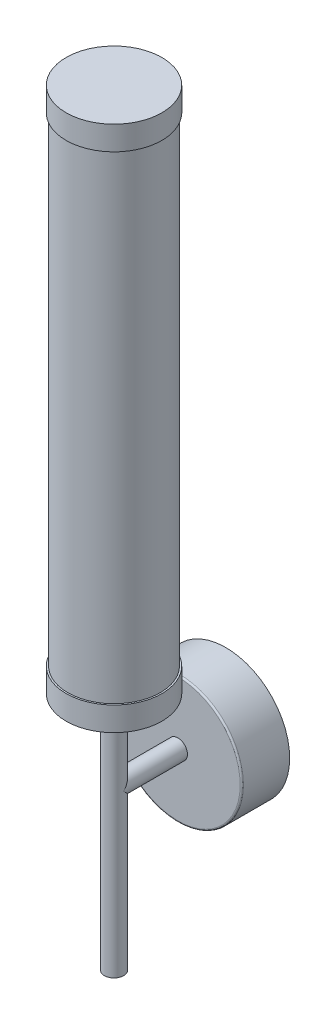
ISO-10303-21;
HEADER;
FILE_DESCRIPTION(('STEP AP214'),'2;1');
FILE_NAME('part.step','',(''),(''),'','','');
FILE_SCHEMA(('AUTOMOTIVE_DESIGN { 1 0 10303 214 1 1 1 1 }'));
ENDSEC;
DATA;
#1=APPLICATION_CONTEXT('core data for automotive mechanical design processes');
#2=APPLICATION_PROTOCOL_DEFINITION('international standard','automotive_design',2000,#1);
#3=PRODUCT_CONTEXT('',#1,'mechanical');
#4=PRODUCT('Part','Part','',(#3));
#5=PRODUCT_RELATED_PRODUCT_CATEGORY('part','',(#4));
#6=PRODUCT_DEFINITION_FORMATION('','',#4);
#7=PRODUCT_DEFINITION_CONTEXT('part definition',#1,'design');
#8=PRODUCT_DEFINITION('design','',#6,#7);
#9=PRODUCT_DEFINITION_SHAPE('','',#8);
#10=(LENGTH_UNIT() NAMED_UNIT(*) SI_UNIT(.MILLI.,.METRE.));
#11=(NAMED_UNIT(*) PLANE_ANGLE_UNIT() SI_UNIT($,.RADIAN.));
#12=(NAMED_UNIT(*) SI_UNIT($,.STERADIAN.) SOLID_ANGLE_UNIT());
#13=UNCERTAINTY_MEASURE_WITH_UNIT(LENGTH_MEASURE(1.E-05),#10,'distance_accuracy_value','');
#14=(GEOMETRIC_REPRESENTATION_CONTEXT(3) GLOBAL_UNCERTAINTY_ASSIGNED_CONTEXT((#13)) GLOBAL_UNIT_ASSIGNED_CONTEXT((#10,
#11,#12)) REPRESENTATION_CONTEXT('',''));
#15=CARTESIAN_POINT('',(0.,0.,0.));
#16=DIRECTION('',(0.,0.,1.));
#17=DIRECTION('',(1.,0.,0.));
#18=AXIS2_PLACEMENT_3D('',#15,#16,#17);
#19=CARTESIAN_POINT('',(-16.5938616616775,11.4490399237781,115.));
#20=DIRECTION('',(0.,0.,-1.));
#21=DIRECTION('',(-1.,0.,0.));
#22=AXIS2_PLACEMENT_3D('',#19,#20,#21);
#23=CYLINDRICAL_SURFACE('',#22,6.);
#24=CARTESIAN_POINT('',(-16.5938616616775,11.4490399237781,75.));
#25=DIRECTION('',(0.,0.,1.));
#26=DIRECTION('',(1.,0.,0.));
#27=AXIS2_PLACEMENT_3D('',#24,#25,#26);
#28=CIRCLE('',#27,6.);
#29=CARTESIAN_POINT('',(-10.5938616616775,11.4490399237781,75.));
#30=VERTEX_POINT('',#29);
#31=EDGE_CURVE('P0_E48',#30,#30,#28,.T.);
#32=ORIENTED_EDGE('',*,*,#31,.T.);
#33=EDGE_LOOP('',(#32));
#34=FACE_BOUND('',#33,.T.);
#35=CARTESIAN_POINT('',(-16.5938616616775,11.4490399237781,115.));
#36=DIRECTION('',(0.,0.707106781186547,-0.707106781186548));
#37=DIRECTION('',(0.,-0.707106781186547,-0.707106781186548));
#38=AXIS2_PLACEMENT_3D('',#35,#36,#37);
#39=ELLIPSE('',#38,8.48528137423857,6.);
#40=CARTESIAN_POINT('',(-22.5938616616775,11.4490399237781,115.));
#41=VERTEX_POINT('',#40);
#42=CARTESIAN_POINT('',(-10.5938616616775,11.4490399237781,115.));
#43=VERTEX_POINT('',#42);
#44=EDGE_CURVE('P0_E31',#41,#43,#39,.F.);
#45=ORIENTED_EDGE('',*,*,#44,.F.);
#46=CARTESIAN_POINT('',(-16.5938616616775,11.4490399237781,115.));
#47=DIRECTION('',(0.,-0.707106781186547,-0.707106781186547));
#48=DIRECTION('',(0.,0.707106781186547,-0.707106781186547));
#49=AXIS2_PLACEMENT_3D('',#46,#47,#48);
#50=ELLIPSE('',#49,8.48528137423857,6.);
#51=EDGE_CURVE('P0_E34',#43,#41,#50,.F.);
#52=ORIENTED_EDGE('',*,*,#51,.F.);
#53=EDGE_LOOP('',(#45,#52));
#54=FACE_BOUND('',#53,.T.);
#55=ADVANCED_FACE('P0_F16',(#34,#54),#23,.T.);
#56=CARTESIAN_POINT('',(-16.5938616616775,11.4490399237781,75.));
#57=DIRECTION('',(0.,0.,-1.));
#58=DIRECTION('',(-1.,0.,0.));
#59=AXIS2_PLACEMENT_3D('',#56,#57,#58);
#60=CYLINDRICAL_SURFACE('',#59,40.);
#61=CARTESIAN_POINT('',(-16.5938616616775,11.4490399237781,74.));
#62=DIRECTION('',(0.,0.,1.));
#63=DIRECTION('',(1.,0.,0.));
#64=AXIS2_PLACEMENT_3D('',#61,#62,#63);
#65=CIRCLE('',#64,40.);
#66=CARTESIAN_POINT('',(23.4061383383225,11.4490399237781,74.));
#67=VERTEX_POINT('',#66);
#68=EDGE_CURVE('P0_E11',#67,#67,#65,.F.);
#69=ORIENTED_EDGE('',*,*,#68,.T.);
#70=EDGE_LOOP('',(#69));
#71=FACE_BOUND('',#70,.T.);
#72=CARTESIAN_POINT('',(-16.5938616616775,11.4490399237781,45.));
#73=DIRECTION('',(0.,0.,1.));
#74=DIRECTION('',(1.,0.,0.));
#75=AXIS2_PLACEMENT_3D('',#72,#73,#74);
#76=CIRCLE('',#75,40.);
#77=CARTESIAN_POINT('',(23.4061383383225,11.4490399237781,45.));
#78=VERTEX_POINT('',#77);
#79=EDGE_CURVE('P0_E42',#78,#78,#76,.T.);
#80=ORIENTED_EDGE('',*,*,#79,.T.);
#81=EDGE_LOOP('',(#80));
#82=FACE_BOUND('',#81,.T.);
#83=ADVANCED_FACE('P0_F74',(#71,#82),#60,.T.);
#84=CARTESIAN_POINT('',(-16.5938616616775,11.4490399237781,75.));
#85=DIRECTION('',(0.,0.,1.));
#86=DIRECTION('',(1.,0.,0.));
#87=AXIS2_PLACEMENT_3D('',#84,#85,#86);
#88=PLANE('',#87);
#89=CARTESIAN_POINT('',(-16.5938616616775,11.4490399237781,75.));
#90=DIRECTION('',(0.,0.,1.));
#91=DIRECTION('',(1.,0.,0.));
#92=AXIS2_PLACEMENT_3D('',#89,#90,#91);
#93=CIRCLE('',#92,39.);
#94=CARTESIAN_POINT('',(22.4061383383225,11.4490399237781,75.));
#95=VERTEX_POINT('',#94);
#96=EDGE_CURVE('P0_E25',#95,#95,#93,.T.);
#97=ORIENTED_EDGE('',*,*,#96,.T.);
#98=EDGE_LOOP('',(#97));
#99=FACE_BOUND('',#98,.T.);
#100=ORIENTED_EDGE('',*,*,#31,.F.);
#101=EDGE_LOOP('',(#100));
#102=FACE_BOUND('',#101,.T.);
#103=ADVANCED_FACE('P0_F59',(#99,#102),#88,.T.);
#104=CARTESIAN_POINT('',(-16.5938616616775,11.4490399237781,45.));
#105=DIRECTION('',(0.,0.,1.));
#106=DIRECTION('',(1.,0.,0.));
#107=AXIS2_PLACEMENT_3D('',#104,#105,#106);
#108=PLANE('',#107);
#109=ORIENTED_EDGE('',*,*,#79,.F.);
#110=EDGE_LOOP('',(#109));
#111=FACE_BOUND('',#110,.T.);
#112=ADVANCED_FACE('P0_F86',(#111),#108,.F.);
#113=CARTESIAN_POINT('',(-16.5938616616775,61.4490399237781,115.));
#114=DIRECTION('',(0.,-1.,0.));
#115=DIRECTION('',(0.,0.,-1.));
#116=AXIS2_PLACEMENT_3D('',#113,#114,#115);
#117=CYLINDRICAL_SURFACE('',#116,6.);
#118=CARTESIAN_POINT('',(-16.5938616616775,61.4490399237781,115.));
#119=DIRECTION('',(0.,1.,0.));
#120=DIRECTION('',(0.,0.,1.));
#121=AXIS2_PLACEMENT_3D('',#118,#119,#120);
#122=CIRCLE('',#121,6.);
#123=CARTESIAN_POINT('',(-16.5938616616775,61.4490399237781,121.));
#124=VERTEX_POINT('',#123);
#125=EDGE_CURVE('P0_E36',#124,#124,#122,.T.);
#126=ORIENTED_EDGE('',*,*,#125,.F.);
#127=EDGE_LOOP('',(#126));
#128=FACE_BOUND('',#127,.T.);
#129=ORIENTED_EDGE('',*,*,#51,.T.);
#130=ORIENTED_EDGE('',*,*,#44,.T.);
#131=EDGE_LOOP('',(#129,#130));
#132=FACE_BOUND('',#131,.T.);
#133=CARTESIAN_POINT('',(-16.5938616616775,-88.5509600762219,115.));
#134=DIRECTION('',(0.,-1.,0.));
#135=DIRECTION('',(0.,0.,-1.));
#136=AXIS2_PLACEMENT_3D('',#133,#134,#135);
#137=CIRCLE('',#136,6.);
#138=CARTESIAN_POINT('',(-16.5938616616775,-88.5509600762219,109.));
#139=VERTEX_POINT('',#138);
#140=EDGE_CURVE('P0_E37',#139,#139,#137,.T.);
#141=ORIENTED_EDGE('',*,*,#140,.F.);
#142=EDGE_LOOP('',(#141));
#143=FACE_BOUND('',#142,.T.);
#144=ADVANCED_FACE('P0_F39',(#128,#132,#143),#117,.T.);
#145=CARTESIAN_POINT('',(-16.5938616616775,61.4490399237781,115.));
#146=DIRECTION('',(0.,1.,0.));
#147=DIRECTION('',(0.,0.,1.));
#148=AXIS2_PLACEMENT_3D('',#145,#146,#147);
#149=PLANE('',#148);
#150=ORIENTED_EDGE('',*,*,#125,.T.);
#151=EDGE_LOOP('',(#150));
#152=FACE_BOUND('',#151,.T.);
#153=ADVANCED_FACE('P0_F69',(#152),#149,.T.);
#154=CARTESIAN_POINT('',(-16.5938616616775,-88.5509600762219,115.));
#155=DIRECTION('',(0.,-1.,0.));
#156=DIRECTION('',(0.,0.,-1.));
#157=AXIS2_PLACEMENT_3D('',#154,#155,#156);
#158=PLANE('',#157);
#159=ORIENTED_EDGE('',*,*,#140,.T.);
#160=EDGE_LOOP('',(#159));
#161=FACE_BOUND('',#160,.T.);
#162=ADVANCED_FACE('P0_F63',(#161),#158,.T.);
#163=CARTESIAN_POINT('',(-16.5938616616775,11.4490399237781,74.));
#164=DIRECTION('',(0.,0.,1.));
#165=DIRECTION('',(1.,0.,0.));
#166=AXIS2_PLACEMENT_3D('',#163,#164,#165);
#167=TOROIDAL_SURFACE('',#166,39.,1.);
#168=ORIENTED_EDGE('',*,*,#68,.F.);
#169=EDGE_LOOP('',(#168));
#170=FACE_BOUND('',#169,.T.);
#171=ORIENTED_EDGE('',*,*,#96,.F.);
#172=EDGE_LOOP('',(#171));
#173=FACE_BOUND('',#172,.T.);
#174=ADVANCED_FACE('P0_F18',(#170,#173),#167,.T.);
#175=CLOSED_SHELL('',(#55,#83,#103,#112,#144,#153,#162,#174));
#176=MANIFOLD_SOLID_BREP('P0_B1',#175);
#177=CARTESIAN_POINT('',(-16.5938616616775,391.449039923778,115.));
#178=DIRECTION('',(0.,-1.,0.));
#179=DIRECTION('',(0.,0.,-1.));
#180=AXIS2_PLACEMENT_3D('',#177,#178,#179);
#181=CYLINDRICAL_SURFACE('',#180,30.);
#182=CARTESIAN_POINT('',(-16.5938616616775,391.449039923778,115.));
#183=DIRECTION('',(0.,1.,0.));
#184=DIRECTION('',(0.,0.,1.));
#185=AXIS2_PLACEMENT_3D('',#182,#183,#184);
#186=CIRCLE('',#185,30.);
#187=CARTESIAN_POINT('',(-16.5938616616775,391.449039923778,145.));
#188=VERTEX_POINT('',#187);
#189=EDGE_CURVE('P1_E10',#188,#188,#186,.T.);
#190=ORIENTED_EDGE('',*,*,#189,.F.);
#191=EDGE_LOOP('',(#190));
#192=FACE_BOUND('',#191,.T.);
#193=CARTESIAN_POINT('',(-16.5938616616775,376.449039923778,115.));
#194=DIRECTION('',(0.,1.,0.));
#195=DIRECTION('',(0.,0.,1.));
#196=AXIS2_PLACEMENT_3D('',#193,#194,#195);
#197=CIRCLE('',#196,30.);
#198=CARTESIAN_POINT('',(-16.5938616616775,376.449039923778,145.));
#199=VERTEX_POINT('',#198);
#200=EDGE_CURVE('P1_E17',#199,#199,#197,.T.);
#201=ORIENTED_EDGE('',*,*,#200,.T.);
#202=EDGE_LOOP('',(#201));
#203=FACE_BOUND('',#202,.T.);
#204=ADVANCED_FACE('P1_F14',(#192,#203),#181,.T.);
#205=CARTESIAN_POINT('',(-16.5938616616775,391.449039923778,115.));
#206=DIRECTION('',(0.,1.,0.));
#207=DIRECTION('',(0.,0.,1.));
#208=AXIS2_PLACEMENT_3D('',#205,#206,#207);
#209=PLANE('',#208);
#210=ORIENTED_EDGE('',*,*,#189,.T.);
#211=EDGE_LOOP('',(#210));
#212=FACE_BOUND('',#211,.T.);
#213=ADVANCED_FACE('P1_F32',(#212),#209,.T.);
#214=CARTESIAN_POINT('',(-16.5938616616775,376.449039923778,115.));
#215=DIRECTION('',(0.,1.,0.));
#216=DIRECTION('',(0.,0.,1.));
#217=AXIS2_PLACEMENT_3D('',#214,#215,#216);
#218=PLANE('',#217);
#219=ORIENTED_EDGE('',*,*,#200,.F.);
#220=EDGE_LOOP('',(#219));
#221=FACE_BOUND('',#220,.T.);
#222=ADVANCED_FACE('P1_F30',(#221),#218,.F.);
#223=CLOSED_SHELL('',(#204,#213,#222));
#224=MANIFOLD_SOLID_BREP('P1_B1',#223);
#225=CARTESIAN_POINT('',(-16.5938616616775,376.449039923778,115.));
#226=DIRECTION('',(0.,-1.,0.));
#227=DIRECTION('',(0.,0.,-1.));
#228=AXIS2_PLACEMENT_3D('',#225,#226,#227);
#229=CYLINDRICAL_SURFACE('',#228,29.);
#230=CARTESIAN_POINT('',(-16.5938616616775,376.449039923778,115.));
#231=DIRECTION('',(0.,1.,0.));
#232=DIRECTION('',(0.,0.,1.));
#233=AXIS2_PLACEMENT_3D('',#230,#231,#232);
#234=CIRCLE('',#233,29.);
#235=CARTESIAN_POINT('',(-16.5938616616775,376.449039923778,144.));
#236=VERTEX_POINT('',#235);
#237=EDGE_CURVE('P2_E10',#236,#236,#234,.T.);
#238=ORIENTED_EDGE('',*,*,#237,.F.);
#239=EDGE_LOOP('',(#238));
#240=FACE_BOUND('',#239,.T.);
#241=CARTESIAN_POINT('',(-16.5938616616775,76.4490399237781,115.));
#242=DIRECTION('',(0.,1.,0.));
#243=DIRECTION('',(0.,0.,1.));
#244=AXIS2_PLACEMENT_3D('',#241,#242,#243);
#245=CIRCLE('',#244,29.);
#246=CARTESIAN_POINT('',(-16.5938616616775,76.4490399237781,144.));
#247=VERTEX_POINT('',#246);
#248=EDGE_CURVE('P2_E17',#247,#247,#245,.T.);
#249=ORIENTED_EDGE('',*,*,#248,.T.);
#250=EDGE_LOOP('',(#249));
#251=FACE_BOUND('',#250,.T.);
#252=ADVANCED_FACE('P2_F14',(#240,#251),#229,.T.);
#253=CARTESIAN_POINT('',(-16.5938616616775,376.449039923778,115.));
#254=DIRECTION('',(0.,1.,0.));
#255=DIRECTION('',(0.,0.,1.));
#256=AXIS2_PLACEMENT_3D('',#253,#254,#255);
#257=PLANE('',#256);
#258=ORIENTED_EDGE('',*,*,#237,.T.);
#259=EDGE_LOOP('',(#258));
#260=FACE_BOUND('',#259,.T.);
#261=ADVANCED_FACE('P2_F32',(#260),#257,.T.);
#262=CARTESIAN_POINT('',(-16.5938616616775,76.4490399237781,115.));
#263=DIRECTION('',(0.,1.,0.));
#264=DIRECTION('',(0.,0.,1.));
#265=AXIS2_PLACEMENT_3D('',#262,#263,#264);
#266=PLANE('',#265);
#267=ORIENTED_EDGE('',*,*,#248,.F.);
#268=EDGE_LOOP('',(#267));
#269=FACE_BOUND('',#268,.T.);
#270=ADVANCED_FACE('P2_F30',(#269),#266,.F.);
#271=CLOSED_SHELL('',(#252,#261,#270));
#272=MANIFOLD_SOLID_BREP('P2_B1',#271);
#273=CARTESIAN_POINT('',(-16.5938616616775,76.4490399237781,115.));
#274=DIRECTION('',(0.,-1.,0.));
#275=DIRECTION('',(0.,0.,-1.));
#276=AXIS2_PLACEMENT_3D('',#273,#274,#275);
#277=CYLINDRICAL_SURFACE('',#276,30.);
#278=CARTESIAN_POINT('',(-16.5938616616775,76.4490399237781,115.));
#279=DIRECTION('',(0.,1.,0.));
#280=DIRECTION('',(0.,0.,1.));
#281=AXIS2_PLACEMENT_3D('',#278,#279,#280);
#282=CIRCLE('',#281,30.);
#283=CARTESIAN_POINT('',(-16.5938616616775,76.4490399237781,145.));
#284=VERTEX_POINT('',#283);
#285=EDGE_CURVE('P3_E9',#284,#284,#282,.T.);
#286=ORIENTED_EDGE('',*,*,#285,.F.);
#287=EDGE_LOOP('',(#286));
#288=FACE_BOUND('',#287,.T.);
#289=CARTESIAN_POINT('',(-16.5938616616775,61.4490399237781,115.));
#290=DIRECTION('',(0.,1.,0.));
#291=DIRECTION('',(0.,0.,1.));
#292=AXIS2_PLACEMENT_3D('',#289,#290,#291);
#293=CIRCLE('',#292,30.);
#294=CARTESIAN_POINT('',(-16.5938616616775,61.4490399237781,145.));
#295=VERTEX_POINT('',#294);
#296=EDGE_CURVE('P3_E16',#295,#295,#293,.T.);
#297=ORIENTED_EDGE('',*,*,#296,.T.);
#298=EDGE_LOOP('',(#297));
#299=FACE_BOUND('',#298,.T.);
#300=ADVANCED_FACE('P3_F13',(#288,#299),#277,.T.);
#301=CARTESIAN_POINT('',(-16.5938616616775,76.4490399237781,115.));
#302=DIRECTION('',(0.,1.,0.));
#303=DIRECTION('',(0.,0.,1.));
#304=AXIS2_PLACEMENT_3D('',#301,#302,#303);
#305=PLANE('',#304);
#306=ORIENTED_EDGE('',*,*,#285,.T.);
#307=EDGE_LOOP('',(#306));
#308=FACE_BOUND('',#307,.T.);
#309=ADVANCED_FACE('P3_F31',(#308),#305,.T.);
#310=CARTESIAN_POINT('',(-16.5938616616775,61.4490399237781,115.));
#311=DIRECTION('',(0.,1.,0.));
#312=DIRECTION('',(0.,0.,1.));
#313=AXIS2_PLACEMENT_3D('',#310,#311,#312);
#314=PLANE('',#313);
#315=ORIENTED_EDGE('',*,*,#296,.F.);
#316=EDGE_LOOP('',(#315));
#317=FACE_BOUND('',#316,.T.);
#318=ADVANCED_FACE('P3_F29',(#317),#314,.F.);
#319=CLOSED_SHELL('',(#300,#309,#318));
#320=MANIFOLD_SOLID_BREP('P3_B1',#319);
#321=ADVANCED_BREP_SHAPE_REPRESENTATION('',(#18,#176,#224,#272,#320),#14);
#322=SHAPE_DEFINITION_REPRESENTATION(#9,#321);
ENDSEC;
END-ISO-10303-21;
